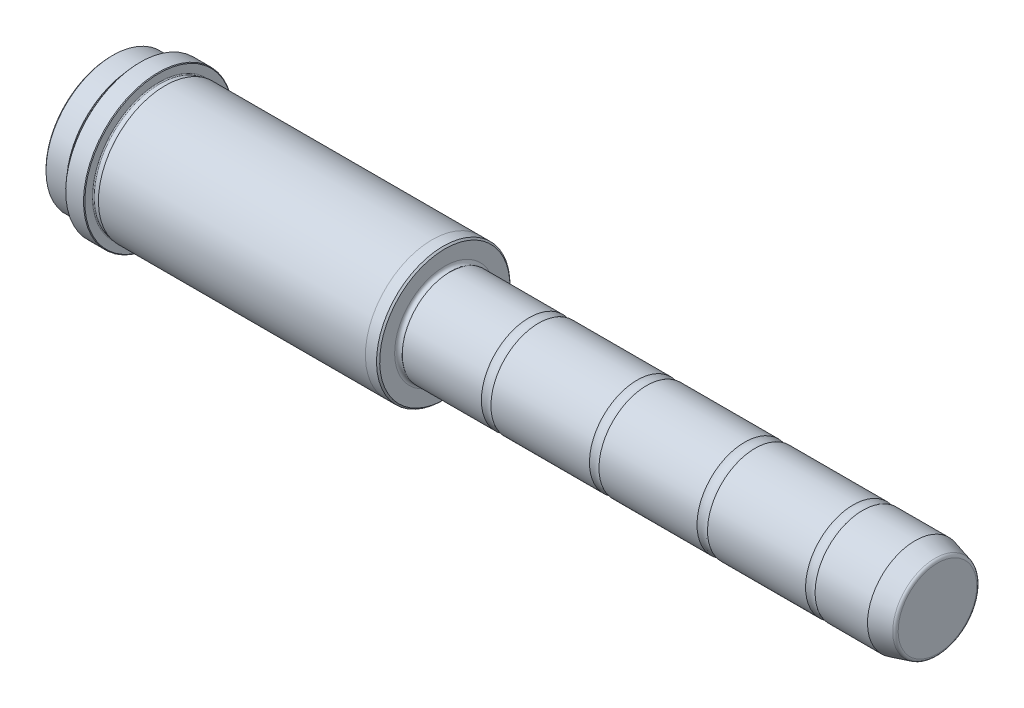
ISO-10303-21;
HEADER;
FILE_DESCRIPTION(('STEP AP214'),'2;1');
FILE_NAME('part.step','',(''),(''),'','','');
FILE_SCHEMA(('AUTOMOTIVE_DESIGN { 1 0 10303 214 1 1 1 1 }'));
ENDSEC;
DATA;
#1=APPLICATION_CONTEXT('core data for automotive mechanical design processes');
#2=APPLICATION_PROTOCOL_DEFINITION('international standard','automotive_design',2000,#1);
#3=PRODUCT_CONTEXT('',#1,'mechanical');
#4=PRODUCT('Part','Part','',(#3));
#5=PRODUCT_RELATED_PRODUCT_CATEGORY('part','',(#4));
#6=PRODUCT_DEFINITION_FORMATION('','',#4);
#7=PRODUCT_DEFINITION_CONTEXT('part definition',#1,'design');
#8=PRODUCT_DEFINITION('design','',#6,#7);
#9=PRODUCT_DEFINITION_SHAPE('','',#8);
#10=(LENGTH_UNIT() NAMED_UNIT(*) SI_UNIT(.MILLI.,.METRE.));
#11=(NAMED_UNIT(*) PLANE_ANGLE_UNIT() SI_UNIT($,.RADIAN.));
#12=(NAMED_UNIT(*) SI_UNIT($,.STERADIAN.) SOLID_ANGLE_UNIT());
#13=UNCERTAINTY_MEASURE_WITH_UNIT(LENGTH_MEASURE(1.E-05),#10,'distance_accuracy_value','');
#14=(GEOMETRIC_REPRESENTATION_CONTEXT(3) GLOBAL_UNCERTAINTY_ASSIGNED_CONTEXT((#13)) GLOBAL_UNIT_ASSIGNED_CONTEXT((#10,
#11,#12)) REPRESENTATION_CONTEXT('',''));
#15=CARTESIAN_POINT('',(0.,0.,0.));
#16=DIRECTION('',(0.,0.,1.));
#17=DIRECTION('',(1.,0.,0.));
#18=AXIS2_PLACEMENT_3D('',#15,#16,#17);
#19=CARTESIAN_POINT('',(155.,0.,0.));
#20=DIRECTION('',(1.,0.,0.));
#21=DIRECTION('',(0.,1.,0.));
#22=AXIS2_PLACEMENT_3D('',#19,#20,#21);
#23=CYLINDRICAL_SURFACE('',#22,15.);
#24=CARTESIAN_POINT('',(1.59999999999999,0.,0.));
#25=DIRECTION('',(1.,0.,0.));
#26=DIRECTION('',(0.,1.,0.));
#27=AXIS2_PLACEMENT_3D('',#24,#25,#26);
#28=CIRCLE('',#27,15.);
#29=CARTESIAN_POINT('',(1.59999999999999,15.,0.));
#30=VERTEX_POINT('',#29);
#31=EDGE_CURVE('E105',#30,#30,#28,.T.);
#32=ORIENTED_EDGE('',*,*,#31,.T.);
#33=EDGE_LOOP('',(#32));
#34=FACE_BOUND('',#33,.T.);
#35=CARTESIAN_POINT('',(26.5033370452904,0.,0.));
#36=DIRECTION('',(-1.,0.,0.));
#37=DIRECTION('',(0.,-1.,0.));
#38=AXIS2_PLACEMENT_3D('',#35,#36,#37);
#39=CIRCLE('',#38,15.);
#40=CARTESIAN_POINT('',(26.5033370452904,-14.9999999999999,0.));
#41=VERTEX_POINT('',#40);
#42=EDGE_CURVE('E132',#41,#41,#39,.T.);
#43=ORIENTED_EDGE('',*,*,#42,.T.);
#44=EDGE_LOOP('',(#43));
#45=FACE_BOUND('',#44,.T.);
#46=ADVANCED_FACE('F28',(#34,#45),#23,.T.);
#47=CARTESIAN_POINT('',(-105.,21.,0.));
#48=DIRECTION('',(-1.,0.,0.));
#49=DIRECTION('',(0.,-1.,0.));
#50=AXIS2_PLACEMENT_3D('',#47,#48,#49);
#51=PLANE('',#50);
#52=CARTESIAN_POINT('',(-105.,0.,0.));
#53=DIRECTION('',(-1.,0.,0.));
#54=DIRECTION('',(0.,-1.,0.));
#55=AXIS2_PLACEMENT_3D('',#52,#53,#54);
#56=CIRCLE('',#55,20.5);
#57=CARTESIAN_POINT('',(-105.,-20.5,0.));
#58=VERTEX_POINT('',#57);
#59=EDGE_CURVE('E39',#58,#58,#56,.T.);
#60=ORIENTED_EDGE('',*,*,#59,.T.);
#61=EDGE_LOOP('',(#60));
#62=FACE_BOUND('',#61,.T.);
#63=ADVANCED_FACE('F155',(#62),#51,.T.);
#64=CARTESIAN_POINT('',(155.,0.,0.));
#65=DIRECTION('',(1.,0.,0.));
#66=DIRECTION('',(0.,1.,0.));
#67=AXIS2_PLACEMENT_3D('',#64,#65,#66);
#68=CYLINDRICAL_SURFACE('',#67,21.);
#69=CARTESIAN_POINT('',(-104.5,0.,0.));
#70=DIRECTION('',(-1.,0.,0.));
#71=DIRECTION('',(0.,-1.,0.));
#72=AXIS2_PLACEMENT_3D('',#69,#70,#71);
#73=CIRCLE('',#72,21.);
#74=CARTESIAN_POINT('',(-104.5,-21.,0.));
#75=VERTEX_POINT('',#74);
#76=EDGE_CURVE('E43',#75,#75,#73,.F.);
#77=ORIENTED_EDGE('',*,*,#76,.T.);
#78=EDGE_LOOP('',(#77));
#79=FACE_BOUND('',#78,.T.);
#80=CARTESIAN_POINT('',(-98.,0.,0.));
#81=DIRECTION('',(1.,0.,0.));
#82=DIRECTION('',(0.,1.,0.));
#83=AXIS2_PLACEMENT_3D('',#80,#81,#82);
#84=CIRCLE('',#83,21.);
#85=CARTESIAN_POINT('',(-98.,21.,0.));
#86=VERTEX_POINT('',#85);
#87=EDGE_CURVE('E66',#86,#86,#84,.T.);
#88=ORIENTED_EDGE('',*,*,#87,.F.);
#89=EDGE_LOOP('',(#88));
#90=FACE_BOUND('',#89,.T.);
#91=ADVANCED_FACE('F163',(#79,#90),#68,.T.);
#92=CARTESIAN_POINT('',(-98.,20.9,0.));
#93=DIRECTION('',(1.,0.,0.));
#94=DIRECTION('',(0.,1.,0.));
#95=AXIS2_PLACEMENT_3D('',#92,#93,#94);
#96=PLANE('',#95);
#97=ORIENTED_EDGE('',*,*,#87,.T.);
#98=EDGE_LOOP('',(#97));
#99=FACE_BOUND('',#98,.T.);
#100=CARTESIAN_POINT('',(-98.,0.,0.));
#101=DIRECTION('',(1.,0.,0.));
#102=DIRECTION('',(0.,1.,0.));
#103=AXIS2_PLACEMENT_3D('',#100,#101,#102);
#104=CIRCLE('',#103,20.9);
#105=CARTESIAN_POINT('',(-98.,20.9,0.));
#106=VERTEX_POINT('',#105);
#107=EDGE_CURVE('E69',#106,#106,#104,.T.);
#108=ORIENTED_EDGE('',*,*,#107,.F.);
#109=EDGE_LOOP('',(#108));
#110=FACE_BOUND('',#109,.T.);
#111=ADVANCED_FACE('F430',(#99,#110),#96,.T.);
#112=CARTESIAN_POINT('',(-97.7,0.,0.));
#113=DIRECTION('',(1.,0.,0.));
#114=DIRECTION('',(0.,1.,0.));
#115=AXIS2_PLACEMENT_3D('',#112,#113,#114);
#116=TOROIDAL_SURFACE('',#115,20.9,0.299999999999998);
#117=ORIENTED_EDGE('',*,*,#107,.T.);
#118=EDGE_LOOP('',(#117));
#119=FACE_BOUND('',#118,.T.);
#120=CARTESIAN_POINT('',(-97.7,0.,0.));
#121=DIRECTION('',(1.,0.,0.));
#122=DIRECTION('',(0.,1.,0.));
#123=AXIS2_PLACEMENT_3D('',#120,#121,#122);
#124=CIRCLE('',#123,20.6);
#125=CARTESIAN_POINT('',(-97.7,20.6,0.));
#126=VERTEX_POINT('',#125);
#127=EDGE_CURVE('E72',#126,#126,#124,.T.);
#128=ORIENTED_EDGE('',*,*,#127,.F.);
#129=EDGE_LOOP('',(#128));
#130=FACE_BOUND('',#129,.T.);
#131=ADVANCED_FACE('F421',(#119,#130),#116,.F.);
#132=CARTESIAN_POINT('',(155.,0.,0.));
#133=DIRECTION('',(1.,0.,0.));
#134=DIRECTION('',(0.,1.,0.));
#135=AXIS2_PLACEMENT_3D('',#132,#133,#134);
#136=CYLINDRICAL_SURFACE('',#135,20.6);
#137=ORIENTED_EDGE('',*,*,#127,.T.);
#138=EDGE_LOOP('',(#137));
#139=FACE_BOUND('',#138,.T.);
#140=CARTESIAN_POINT('',(-96.3,0.,0.));
#141=DIRECTION('',(1.,0.,0.));
#142=DIRECTION('',(0.,1.,0.));
#143=AXIS2_PLACEMENT_3D('',#140,#141,#142);
#144=CIRCLE('',#143,20.6);
#145=CARTESIAN_POINT('',(-96.3,20.6,0.));
#146=VERTEX_POINT('',#145);
#147=EDGE_CURVE('E75',#146,#146,#144,.T.);
#148=ORIENTED_EDGE('',*,*,#147,.F.);
#149=EDGE_LOOP('',(#148));
#150=FACE_BOUND('',#149,.T.);
#151=ADVANCED_FACE('F412',(#139,#150),#136,.T.);
#152=CARTESIAN_POINT('',(-96.3,0.,0.));
#153=DIRECTION('',(1.,0.,0.));
#154=DIRECTION('',(0.,1.,0.));
#155=AXIS2_PLACEMENT_3D('',#152,#153,#154);
#156=TOROIDAL_SURFACE('',#155,20.9,0.299999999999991);
#157=ORIENTED_EDGE('',*,*,#147,.T.);
#158=EDGE_LOOP('',(#157));
#159=FACE_BOUND('',#158,.T.);
#160=CARTESIAN_POINT('',(-96.,0.,0.));
#161=DIRECTION('',(1.,0.,0.));
#162=DIRECTION('',(0.,1.,0.));
#163=AXIS2_PLACEMENT_3D('',#160,#161,#162);
#164=CIRCLE('',#163,20.9);
#165=CARTESIAN_POINT('',(-96.,20.9,0.));
#166=VERTEX_POINT('',#165);
#167=EDGE_CURVE('E78',#166,#166,#164,.T.);
#168=ORIENTED_EDGE('',*,*,#167,.F.);
#169=EDGE_LOOP('',(#168));
#170=FACE_BOUND('',#169,.T.);
#171=ADVANCED_FACE('F404',(#159,#170),#156,.F.);
#172=CARTESIAN_POINT('',(-96.,23.5,0.));
#173=DIRECTION('',(-1.,0.,0.));
#174=DIRECTION('',(0.,-1.,0.));
#175=AXIS2_PLACEMENT_3D('',#172,#173,#174);
#176=PLANE('',#175);
#177=CARTESIAN_POINT('',(-96.,0.,0.));
#178=DIRECTION('',(-1.,0.,0.));
#179=DIRECTION('',(0.,-1.,0.));
#180=AXIS2_PLACEMENT_3D('',#177,#178,#179);
#181=CIRCLE('',#180,23.3);
#182=CARTESIAN_POINT('',(-96.,-23.3,0.));
#183=VERTEX_POINT('',#182);
#184=EDGE_CURVE('E51',#183,#183,#181,.T.);
#185=ORIENTED_EDGE('',*,*,#184,.T.);
#186=EDGE_LOOP('',(#185));
#187=FACE_BOUND('',#186,.T.);
#188=ORIENTED_EDGE('',*,*,#167,.T.);
#189=EDGE_LOOP('',(#188));
#190=FACE_BOUND('',#189,.T.);
#191=ADVANCED_FACE('F396',(#187,#190),#176,.T.);
#192=CARTESIAN_POINT('',(155.,0.,0.));
#193=DIRECTION('',(1.,0.,0.));
#194=DIRECTION('',(0.,1.,0.));
#195=AXIS2_PLACEMENT_3D('',#192,#193,#194);
#196=CYLINDRICAL_SURFACE('',#195,23.5);
#197=CARTESIAN_POINT('',(-95.8,0.,0.));
#198=DIRECTION('',(-1.,0.,0.));
#199=DIRECTION('',(0.,-1.,0.));
#200=AXIS2_PLACEMENT_3D('',#197,#198,#199);
#201=CIRCLE('',#200,23.5);
#202=CARTESIAN_POINT('',(-95.8,-23.5,0.));
#203=VERTEX_POINT('',#202);
#204=EDGE_CURVE('E54',#203,#203,#201,.F.);
#205=ORIENTED_EDGE('',*,*,#204,.T.);
#206=EDGE_LOOP('',(#205));
#207=FACE_BOUND('',#206,.T.);
#208=CARTESIAN_POINT('',(-90.2,0.,0.));
#209=DIRECTION('',(1.,0.,0.));
#210=DIRECTION('',(0.,1.,0.));
#211=AXIS2_PLACEMENT_3D('',#208,#209,#210);
#212=CIRCLE('',#211,23.5);
#213=CARTESIAN_POINT('',(-90.2,-23.5,0.));
#214=VERTEX_POINT('',#213);
#215=EDGE_CURVE('E57',#214,#214,#212,.F.);
#216=ORIENTED_EDGE('',*,*,#215,.T.);
#217=EDGE_LOOP('',(#216));
#218=FACE_BOUND('',#217,.T.);
#219=ADVANCED_FACE('F387',(#207,#218),#196,.T.);
#220=CARTESIAN_POINT('',(-90.,20.9,0.));
#221=DIRECTION('',(1.,0.,0.));
#222=DIRECTION('',(0.,1.,0.));
#223=AXIS2_PLACEMENT_3D('',#220,#221,#222);
#224=PLANE('',#223);
#225=CARTESIAN_POINT('',(-90.,0.,0.));
#226=DIRECTION('',(1.,0.,0.));
#227=DIRECTION('',(0.,1.,0.));
#228=AXIS2_PLACEMENT_3D('',#225,#226,#227);
#229=CIRCLE('',#228,23.3);
#230=CARTESIAN_POINT('',(-90.,-23.3,0.));
#231=VERTEX_POINT('',#230);
#232=EDGE_CURVE('E48',#231,#231,#229,.T.);
#233=ORIENTED_EDGE('',*,*,#232,.T.);
#234=EDGE_LOOP('',(#233));
#235=FACE_BOUND('',#234,.T.);
#236=CARTESIAN_POINT('',(-90.,0.,0.));
#237=DIRECTION('',(1.,0.,0.));
#238=DIRECTION('',(0.,1.,0.));
#239=AXIS2_PLACEMENT_3D('',#236,#237,#238);
#240=CIRCLE('',#239,20.9);
#241=CARTESIAN_POINT('',(-90.,20.9,0.));
#242=VERTEX_POINT('',#241);
#243=EDGE_CURVE('E81',#242,#242,#240,.T.);
#244=ORIENTED_EDGE('',*,*,#243,.F.);
#245=EDGE_LOOP('',(#244));
#246=FACE_BOUND('',#245,.T.);
#247=ADVANCED_FACE('F378',(#235,#246),#224,.T.);
#248=CARTESIAN_POINT('',(-89.7,0.,0.));
#249=DIRECTION('',(1.,0.,0.));
#250=DIRECTION('',(0.,1.,0.));
#251=AXIS2_PLACEMENT_3D('',#248,#249,#250);
#252=TOROIDAL_SURFACE('',#251,20.9,0.299999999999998);
#253=ORIENTED_EDGE('',*,*,#243,.T.);
#254=EDGE_LOOP('',(#253));
#255=FACE_BOUND('',#254,.T.);
#256=CARTESIAN_POINT('',(-89.7,0.,0.));
#257=DIRECTION('',(1.,0.,0.));
#258=DIRECTION('',(0.,1.,0.));
#259=AXIS2_PLACEMENT_3D('',#256,#257,#258);
#260=CIRCLE('',#259,20.6);
#261=CARTESIAN_POINT('',(-89.7,20.6,0.));
#262=VERTEX_POINT('',#261);
#263=EDGE_CURVE('E84',#262,#262,#260,.T.);
#264=ORIENTED_EDGE('',*,*,#263,.F.);
#265=EDGE_LOOP('',(#264));
#266=FACE_BOUND('',#265,.T.);
#267=ADVANCED_FACE('F369',(#255,#266),#252,.F.);
#268=CARTESIAN_POINT('',(155.,0.,0.));
#269=DIRECTION('',(1.,0.,0.));
#270=DIRECTION('',(0.,1.,0.));
#271=AXIS2_PLACEMENT_3D('',#268,#269,#270);
#272=CYLINDRICAL_SURFACE('',#271,20.6);
#273=ORIENTED_EDGE('',*,*,#263,.T.);
#274=EDGE_LOOP('',(#273));
#275=FACE_BOUND('',#274,.T.);
#276=CARTESIAN_POINT('',(-88.3,0.,0.));
#277=DIRECTION('',(1.,0.,0.));
#278=DIRECTION('',(0.,1.,0.));
#279=AXIS2_PLACEMENT_3D('',#276,#277,#278);
#280=CIRCLE('',#279,20.6);
#281=CARTESIAN_POINT('',(-88.3,20.6,0.));
#282=VERTEX_POINT('',#281);
#283=EDGE_CURVE('E87',#282,#282,#280,.T.);
#284=ORIENTED_EDGE('',*,*,#283,.F.);
#285=EDGE_LOOP('',(#284));
#286=FACE_BOUND('',#285,.T.);
#287=ADVANCED_FACE('F360',(#275,#286),#272,.T.);
#288=CARTESIAN_POINT('',(-88.3,0.,0.));
#289=DIRECTION('',(1.,0.,0.));
#290=DIRECTION('',(0.,1.,0.));
#291=AXIS2_PLACEMENT_3D('',#288,#289,#290);
#292=TOROIDAL_SURFACE('',#291,20.9,0.299999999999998);
#293=ORIENTED_EDGE('',*,*,#283,.T.);
#294=EDGE_LOOP('',(#293));
#295=FACE_BOUND('',#294,.T.);
#296=CARTESIAN_POINT('',(-88.,0.,0.));
#297=DIRECTION('',(1.,0.,0.));
#298=DIRECTION('',(0.,1.,0.));
#299=AXIS2_PLACEMENT_3D('',#296,#297,#298);
#300=CIRCLE('',#299,20.9);
#301=CARTESIAN_POINT('',(-88.,20.9,0.));
#302=VERTEX_POINT('',#301);
#303=EDGE_CURVE('E90',#302,#302,#300,.T.);
#304=ORIENTED_EDGE('',*,*,#303,.F.);
#305=EDGE_LOOP('',(#304));
#306=FACE_BOUND('',#305,.T.);
#307=ADVANCED_FACE('F351',(#295,#306),#292,.F.);
#308=CARTESIAN_POINT('',(-88.,21.0001,0.));
#309=DIRECTION('',(-1.,0.,0.));
#310=DIRECTION('',(0.,-1.,0.));
#311=AXIS2_PLACEMENT_3D('',#308,#309,#310);
#312=PLANE('',#311);
#313=ORIENTED_EDGE('',*,*,#303,.T.);
#314=EDGE_LOOP('',(#313));
#315=FACE_BOUND('',#314,.T.);
#316=CARTESIAN_POINT('',(-88.,0.,0.));
#317=DIRECTION('',(1.,0.,0.));
#318=DIRECTION('',(0.,1.,0.));
#319=AXIS2_PLACEMENT_3D('',#316,#317,#318);
#320=CIRCLE('',#319,21.0001);
#321=CARTESIAN_POINT('',(-88.,21.0001,0.));
#322=VERTEX_POINT('',#321);
#323=EDGE_CURVE('E93',#322,#322,#320,.T.);
#324=ORIENTED_EDGE('',*,*,#323,.F.);
#325=EDGE_LOOP('',(#324));
#326=FACE_BOUND('',#325,.T.);
#327=ADVANCED_FACE('F342',(#315,#326),#312,.T.);
#328=CARTESIAN_POINT('',(155.,0.,0.));
#329=DIRECTION('',(1.,0.,0.));
#330=DIRECTION('',(0.,1.,0.));
#331=AXIS2_PLACEMENT_3D('',#328,#329,#330);
#332=CYLINDRICAL_SURFACE('',#331,21.0001);
#333=ORIENTED_EDGE('',*,*,#323,.T.);
#334=EDGE_LOOP('',(#333));
#335=FACE_BOUND('',#334,.T.);
#336=CARTESIAN_POINT('',(-4.,0.,0.));
#337=DIRECTION('',(1.,0.,0.));
#338=DIRECTION('',(0.,1.,0.));
#339=AXIS2_PLACEMENT_3D('',#336,#337,#338);
#340=CIRCLE('',#339,21.0001);
#341=CARTESIAN_POINT('',(-4.00000000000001,21.0001,0.));
#342=VERTEX_POINT('',#341);
#343=EDGE_CURVE('E96',#342,#342,#340,.T.);
#344=ORIENTED_EDGE('',*,*,#343,.F.);
#345=EDGE_LOOP('',(#344));
#346=FACE_BOUND('',#345,.T.);
#347=ADVANCED_FACE('F333',(#335,#346),#332,.T.);
#348=CARTESIAN_POINT('',(-4.,21.0001,0.));
#349=DIRECTION('',(1.,0.,0.));
#350=DIRECTION('',(0.,1.,0.));
#351=AXIS2_PLACEMENT_3D('',#348,#349,#350);
#352=PLANE('',#351);
#353=ORIENTED_EDGE('',*,*,#343,.T.);
#354=EDGE_LOOP('',(#353));
#355=FACE_BOUND('',#354,.T.);
#356=CARTESIAN_POINT('',(-4.,0.,0.));
#357=DIRECTION('',(1.,0.,0.));
#358=DIRECTION('',(0.,1.,0.));
#359=AXIS2_PLACEMENT_3D('',#356,#357,#358);
#360=CIRCLE('',#359,21.);
#361=CARTESIAN_POINT('',(-4.00000000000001,21.,0.));
#362=VERTEX_POINT('',#361);
#363=EDGE_CURVE('E99',#362,#362,#360,.T.);
#364=ORIENTED_EDGE('',*,*,#363,.F.);
#365=EDGE_LOOP('',(#364));
#366=FACE_BOUND('',#365,.T.);
#367=ADVANCED_FACE('F325',(#355,#366),#352,.T.);
#368=CARTESIAN_POINT('',(155.,0.,0.));
#369=DIRECTION('',(1.,0.,0.));
#370=DIRECTION('',(0.,1.,0.));
#371=AXIS2_PLACEMENT_3D('',#368,#369,#370);
#372=CYLINDRICAL_SURFACE('',#371,21.);
#373=CARTESIAN_POINT('',(-0.500000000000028,0.,0.));
#374=DIRECTION('',(1.,0.,0.));
#375=DIRECTION('',(0.,1.,0.));
#376=AXIS2_PLACEMENT_3D('',#373,#374,#375);
#377=CIRCLE('',#376,21.);
#378=CARTESIAN_POINT('',(-0.500000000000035,21.,0.));
#379=VERTEX_POINT('',#378);
#380=EDGE_CURVE('E10',#379,#379,#377,.F.);
#381=ORIENTED_EDGE('',*,*,#380,.T.);
#382=EDGE_LOOP('',(#381));
#383=FACE_BOUND('',#382,.T.);
#384=ORIENTED_EDGE('',*,*,#363,.T.);
#385=EDGE_LOOP('',(#384));
#386=FACE_BOUND('',#385,.T.);
#387=ADVANCED_FACE('F317',(#383,#386),#372,.T.);
#388=CARTESIAN_POINT('',(0.,15.8,0.));
#389=DIRECTION('',(1.,0.,0.));
#390=DIRECTION('',(0.,1.,0.));
#391=AXIS2_PLACEMENT_3D('',#388,#389,#390);
#392=PLANE('',#391);
#393=CARTESIAN_POINT('',(0.,0.,0.));
#394=DIRECTION('',(1.,0.,0.));
#395=DIRECTION('',(0.,1.,0.));
#396=AXIS2_PLACEMENT_3D('',#393,#394,#395);
#397=CIRCLE('',#396,20.5);
#398=CARTESIAN_POINT('',(0.,20.5,0.));
#399=VERTEX_POINT('',#398);
#400=EDGE_CURVE('E35',#399,#399,#397,.T.);
#401=ORIENTED_EDGE('',*,*,#400,.T.);
#402=EDGE_LOOP('',(#401));
#403=FACE_BOUND('',#402,.T.);
#404=CARTESIAN_POINT('',(0.,0.,0.));
#405=DIRECTION('',(1.,0.,0.));
#406=DIRECTION('',(0.,1.,0.));
#407=AXIS2_PLACEMENT_3D('',#404,#405,#406);
#408=CIRCLE('',#407,15.8);
#409=CARTESIAN_POINT('',(0.,15.8,0.));
#410=VERTEX_POINT('',#409);
#411=EDGE_CURVE('E102',#410,#410,#408,.T.);
#412=ORIENTED_EDGE('',*,*,#411,.F.);
#413=EDGE_LOOP('',(#412));
#414=FACE_BOUND('',#413,.T.);
#415=ADVANCED_FACE('F150',(#403,#414),#392,.T.);
#416=CARTESIAN_POINT('',(1.,0.,0.));
#417=DIRECTION('',(1.,0.,0.));
#418=DIRECTION('',(0.,1.,0.));
#419=AXIS2_PLACEMENT_3D('',#416,#417,#418);
#420=TOROIDAL_SURFACE('',#419,15.8,1.);
#421=ORIENTED_EDGE('',*,*,#411,.T.);
#422=EDGE_LOOP('',(#421));
#423=FACE_BOUND('',#422,.T.);
#424=ORIENTED_EDGE('',*,*,#31,.F.);
#425=EDGE_LOOP('',(#424));
#426=FACE_BOUND('',#425,.T.);
#427=ADVANCED_FACE('F140',(#423,#426),#420,.F.);
#428=CARTESIAN_POINT('',(28.,0.,0.));
#429=DIRECTION('',(-1.,0.,0.));
#430=DIRECTION('',(0.,-1.,0.));
#431=AXIS2_PLACEMENT_3D('',#428,#429,#430);
#432=TOROIDAL_SURFACE('',#431,17.6,3.);
#433=CARTESIAN_POINT('',(29.4966629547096,0.,0.));
#434=DIRECTION('',(-1.,0.,0.));
#435=DIRECTION('',(0.,-1.,0.));
#436=AXIS2_PLACEMENT_3D('',#433,#434,#435);
#437=CIRCLE('',#436,15.);
#438=CARTESIAN_POINT('',(29.4966629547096,-14.9999999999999,0.));
#439=VERTEX_POINT('',#438);
#440=EDGE_CURVE('E129',#439,#439,#437,.T.);
#441=ORIENTED_EDGE('',*,*,#440,.T.);
#442=EDGE_LOOP('',(#441));
#443=FACE_BOUND('',#442,.T.);
#444=ORIENTED_EDGE('',*,*,#42,.F.);
#445=EDGE_LOOP('',(#444));
#446=FACE_BOUND('',#445,.T.);
#447=ADVANCED_FACE('F137',(#443,#446),#432,.F.);
#448=CARTESIAN_POINT('',(155.,13.1243556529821,0.));
#449=DIRECTION('',(1.,0.,0.));
#450=DIRECTION('',(0.,1.,0.));
#451=AXIS2_PLACEMENT_3D('',#448,#449,#450);
#452=PLANE('',#451);
#453=CARTESIAN_POINT('',(155.,0.,0.));
#454=DIRECTION('',(1.,0.,0.));
#455=DIRECTION('',(0.,1.,0.));
#456=AXIS2_PLACEMENT_3D('',#453,#454,#455);
#457=CIRCLE('',#456,12.3570286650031);
#458=CARTESIAN_POINT('',(155.,12.3570286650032,0.));
#459=VERTEX_POINT('',#458);
#460=EDGE_CURVE('E63',#459,#459,#457,.T.);
#461=ORIENTED_EDGE('',*,*,#460,.T.);
#462=EDGE_LOOP('',(#461));
#463=FACE_BOUND('',#462,.T.);
#464=ADVANCED_FACE('F139',(#463),#452,.T.);
#465=CARTESIAN_POINT('',(155.,0.,0.));
#466=DIRECTION('',(-1.,0.,0.));
#467=DIRECTION('',(0.,-1.,0.));
#468=AXIS2_PLACEMENT_3D('',#465,#466,#467);
#469=CONICAL_SURFACE('',#468,13.1243556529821,0.26179938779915);
#470=CARTESIAN_POINT('',(154.258819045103,0.,0.));
#471=DIRECTION('',(1.,0.,0.));
#472=DIRECTION('',(0.,1.,0.));
#473=AXIS2_PLACEMENT_3D('',#470,#471,#472);
#474=CIRCLE('',#473,13.3229544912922);
#475=CARTESIAN_POINT('',(154.258819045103,13.3229544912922,0.));
#476=VERTEX_POINT('',#475);
#477=EDGE_CURVE('E60',#476,#476,#474,.F.);
#478=ORIENTED_EDGE('',*,*,#477,.T.);
#479=EDGE_LOOP('',(#478));
#480=FACE_BOUND('',#479,.T.);
#481=CARTESIAN_POINT('',(148.,0.,0.));
#482=DIRECTION('',(1.,0.,0.));
#483=DIRECTION('',(0.,1.,0.));
#484=AXIS2_PLACEMENT_3D('',#481,#482,#483);
#485=CIRCLE('',#484,14.9999999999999);
#486=CARTESIAN_POINT('',(148.,15.,0.));
#487=VERTEX_POINT('',#486);
#488=EDGE_CURVE('E108',#487,#487,#485,.T.);
#489=ORIENTED_EDGE('',*,*,#488,.T.);
#490=EDGE_LOOP('',(#489));
#491=FACE_BOUND('',#490,.T.);
#492=ADVANCED_FACE('F147',(#480,#491),#469,.T.);
#493=ORIENTED_EDGE('',*,*,#488,.F.);
#494=EDGE_LOOP('',(#493));
#495=FACE_BOUND('',#494,.T.);
#496=CARTESIAN_POINT('',(131.49666295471,0.,0.));
#497=DIRECTION('',(-1.,0.,0.));
#498=DIRECTION('',(0.,-1.,0.));
#499=AXIS2_PLACEMENT_3D('',#496,#497,#498);
#500=CIRCLE('',#499,15.);
#501=CARTESIAN_POINT('',(131.49666295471,-14.9999999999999,0.));
#502=VERTEX_POINT('',#501);
#503=EDGE_CURVE('E111',#502,#502,#500,.T.);
#504=ORIENTED_EDGE('',*,*,#503,.F.);
#505=EDGE_LOOP('',(#504));
#506=FACE_BOUND('',#505,.T.);
#507=ADVANCED_FACE('F159',(#495,#506),#23,.T.);
#508=CARTESIAN_POINT('',(130.,0.,0.));
#509=DIRECTION('',(-1.,0.,0.));
#510=DIRECTION('',(0.,-1.,0.));
#511=AXIS2_PLACEMENT_3D('',#508,#509,#510);
#512=TOROIDAL_SURFACE('',#511,17.6,3.);
#513=ORIENTED_EDGE('',*,*,#503,.T.);
#514=EDGE_LOOP('',(#513));
#515=FACE_BOUND('',#514,.T.);
#516=CARTESIAN_POINT('',(128.50333704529,0.,0.));
#517=DIRECTION('',(-1.,0.,0.));
#518=DIRECTION('',(0.,-1.,0.));
#519=AXIS2_PLACEMENT_3D('',#516,#517,#518);
#520=CIRCLE('',#519,15.);
#521=CARTESIAN_POINT('',(128.50333704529,-14.9999999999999,0.));
#522=VERTEX_POINT('',#521);
#523=EDGE_CURVE('E114',#522,#522,#520,.T.);
#524=ORIENTED_EDGE('',*,*,#523,.F.);
#525=EDGE_LOOP('',(#524));
#526=FACE_BOUND('',#525,.T.);
#527=ADVANCED_FACE('F173',(#515,#526),#512,.F.);
#528=ORIENTED_EDGE('',*,*,#523,.T.);
#529=EDGE_LOOP('',(#528));
#530=FACE_BOUND('',#529,.T.);
#531=CARTESIAN_POINT('',(97.6583123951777,0.,0.));
#532=DIRECTION('',(-1.,0.,0.));
#533=DIRECTION('',(0.,-1.,0.));
#534=AXIS2_PLACEMENT_3D('',#531,#532,#533);
#535=CIRCLE('',#534,15.);
#536=CARTESIAN_POINT('',(97.6583123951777,-14.9999999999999,0.));
#537=VERTEX_POINT('',#536);
#538=EDGE_CURVE('E117',#537,#537,#535,.T.);
#539=ORIENTED_EDGE('',*,*,#538,.F.);
#540=EDGE_LOOP('',(#539));
#541=FACE_BOUND('',#540,.T.);
#542=ADVANCED_FACE('F175',(#530,#541),#23,.T.);
#543=CARTESIAN_POINT('',(96.,0.,0.));
#544=DIRECTION('',(-1.,0.,0.));
#545=DIRECTION('',(0.,-1.,0.));
#546=AXIS2_PLACEMENT_3D('',#543,#544,#545);
#547=TOROIDAL_SURFACE('',#546,17.5,3.00000000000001);
#548=ORIENTED_EDGE('',*,*,#538,.T.);
#549=EDGE_LOOP('',(#548));
#550=FACE_BOUND('',#549,.T.);
#551=CARTESIAN_POINT('',(94.3416876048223,0.,0.));
#552=DIRECTION('',(-1.,0.,0.));
#553=DIRECTION('',(0.,-1.,0.));
#554=AXIS2_PLACEMENT_3D('',#551,#552,#553);
#555=CIRCLE('',#554,15.);
#556=CARTESIAN_POINT('',(94.3416876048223,-14.9999999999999,0.));
#557=VERTEX_POINT('',#556);
#558=EDGE_CURVE('E120',#557,#557,#555,.T.);
#559=ORIENTED_EDGE('',*,*,#558,.F.);
#560=EDGE_LOOP('',(#559));
#561=FACE_BOUND('',#560,.T.);
#562=ADVANCED_FACE('F186',(#550,#561),#547,.F.);
#563=ORIENTED_EDGE('',*,*,#558,.T.);
#564=EDGE_LOOP('',(#563));
#565=FACE_BOUND('',#564,.T.);
#566=CARTESIAN_POINT('',(63.4966629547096,0.,0.));
#567=DIRECTION('',(-1.,0.,0.));
#568=DIRECTION('',(0.,-1.,0.));
#569=AXIS2_PLACEMENT_3D('',#566,#567,#568);
#570=CIRCLE('',#569,15.);
#571=CARTESIAN_POINT('',(63.4966629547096,-14.9999999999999,0.));
#572=VERTEX_POINT('',#571);
#573=EDGE_CURVE('E123',#572,#572,#570,.T.);
#574=ORIENTED_EDGE('',*,*,#573,.F.);
#575=EDGE_LOOP('',(#574));
#576=FACE_BOUND('',#575,.T.);
#577=ADVANCED_FACE('F171',(#565,#576),#23,.T.);
#578=CARTESIAN_POINT('',(62.,0.,0.));
#579=DIRECTION('',(-1.,0.,0.));
#580=DIRECTION('',(0.,-1.,0.));
#581=AXIS2_PLACEMENT_3D('',#578,#579,#580);
#582=TOROIDAL_SURFACE('',#581,17.6,3.);
#583=ORIENTED_EDGE('',*,*,#573,.T.);
#584=EDGE_LOOP('',(#583));
#585=FACE_BOUND('',#584,.T.);
#586=CARTESIAN_POINT('',(60.5033370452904,0.,0.));
#587=DIRECTION('',(-1.,0.,0.));
#588=DIRECTION('',(0.,-1.,0.));
#589=AXIS2_PLACEMENT_3D('',#586,#587,#588);
#590=CIRCLE('',#589,15.);
#591=CARTESIAN_POINT('',(60.5033370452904,-14.9999999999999,0.));
#592=VERTEX_POINT('',#591);
#593=EDGE_CURVE('E126',#592,#592,#590,.T.);
#594=ORIENTED_EDGE('',*,*,#593,.F.);
#595=EDGE_LOOP('',(#594));
#596=FACE_BOUND('',#595,.T.);
#597=ADVANCED_FACE('F169',(#585,#596),#582,.F.);
#598=ORIENTED_EDGE('',*,*,#593,.T.);
#599=EDGE_LOOP('',(#598));
#600=FACE_BOUND('',#599,.T.);
#601=ORIENTED_EDGE('',*,*,#440,.F.);
#602=EDGE_LOOP('',(#601));
#603=FACE_BOUND('',#602,.T.);
#604=ADVANCED_FACE('F158',(#600,#603),#23,.T.);
#605=CARTESIAN_POINT('',(154.,0.,0.));
#606=DIRECTION('',(1.,0.,0.));
#607=DIRECTION('',(0.,1.,0.));
#608=AXIS2_PLACEMENT_3D('',#605,#606,#607);
#609=TOROIDAL_SURFACE('',#608,12.3570286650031,1.);
#610=ORIENTED_EDGE('',*,*,#477,.F.);
#611=EDGE_LOOP('',(#610));
#612=FACE_BOUND('',#611,.T.);
#613=ORIENTED_EDGE('',*,*,#460,.F.);
#614=EDGE_LOOP('',(#613));
#615=FACE_BOUND('',#614,.T.);
#616=ADVANCED_FACE('F168',(#612,#615),#609,.T.);
#617=CARTESIAN_POINT('',(-95.8,0.,0.));
#618=DIRECTION('',(1.,0.,0.));
#619=DIRECTION('',(0.,1.,0.));
#620=AXIS2_PLACEMENT_3D('',#617,#618,#619);
#621=CONICAL_SURFACE('',#620,23.5,0.785398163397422);
#622=ORIENTED_EDGE('',*,*,#184,.F.);
#623=EDGE_LOOP('',(#622));
#624=FACE_BOUND('',#623,.T.);
#625=ORIENTED_EDGE('',*,*,#204,.F.);
#626=EDGE_LOOP('',(#625));
#627=FACE_BOUND('',#626,.T.);
#628=ADVANCED_FACE('F221',(#624,#627),#621,.T.);
#629=CARTESIAN_POINT('',(-90.,0.,0.));
#630=DIRECTION('',(-1.,0.,0.));
#631=DIRECTION('',(0.,-1.,0.));
#632=AXIS2_PLACEMENT_3D('',#629,#630,#631);
#633=CONICAL_SURFACE('',#632,23.3,0.785398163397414);
#634=CARTESIAN_POINT('',(-90.2,-23.5,0.));
#635=CARTESIAN_POINT('',(-90.1979166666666,-23.4979166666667,0.));
#636=CARTESIAN_POINT('',(-90.1958333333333,-23.4958333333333,0.));
#637=CARTESIAN_POINT('',(-90.1916666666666,-23.4916666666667,0.));
#638=CARTESIAN_POINT('',(-90.1895833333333,-23.4895833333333,0.));
#639=CARTESIAN_POINT('',(-90.1854166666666,-23.4854166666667,0.));
#640=CARTESIAN_POINT('',(-90.1833333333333,-23.4833333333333,0.));
#641=CARTESIAN_POINT('',(-90.1791666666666,-23.4791666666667,0.));
#642=CARTESIAN_POINT('',(-90.1770833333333,-23.4770833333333,0.));
#643=CARTESIAN_POINT('',(-90.1729166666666,-23.4729166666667,0.));
#644=CARTESIAN_POINT('',(-90.1708333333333,-23.4708333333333,0.));
#645=CARTESIAN_POINT('',(-90.1666666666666,-23.4666666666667,0.));
#646=CARTESIAN_POINT('',(-90.1645833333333,-23.4645833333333,0.));
#647=CARTESIAN_POINT('',(-90.1604166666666,-23.4604166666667,0.));
#648=CARTESIAN_POINT('',(-90.1583333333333,-23.4583333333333,0.));
#649=CARTESIAN_POINT('',(-90.1541666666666,-23.4541666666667,0.));
#650=CARTESIAN_POINT('',(-90.1520833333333,-23.4520833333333,0.));
#651=CARTESIAN_POINT('',(-90.1479166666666,-23.4479166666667,0.));
#652=CARTESIAN_POINT('',(-90.1458333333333,-23.4458333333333,0.));
#653=CARTESIAN_POINT('',(-90.1416666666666,-23.4416666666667,0.));
#654=CARTESIAN_POINT('',(-90.1395833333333,-23.4395833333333,0.));
#655=CARTESIAN_POINT('',(-90.1354166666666,-23.4354166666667,0.));
#656=CARTESIAN_POINT('',(-90.1333333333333,-23.4333333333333,0.));
#657=CARTESIAN_POINT('',(-90.1291666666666,-23.4291666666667,0.));
#658=CARTESIAN_POINT('',(-90.1270833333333,-23.4270833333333,0.));
#659=CARTESIAN_POINT('',(-90.1229166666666,-23.4229166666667,0.));
#660=CARTESIAN_POINT('',(-90.1208333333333,-23.4208333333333,0.));
#661=CARTESIAN_POINT('',(-90.1166666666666,-23.4166666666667,0.));
#662=CARTESIAN_POINT('',(-90.1145833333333,-23.4145833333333,0.));
#663=CARTESIAN_POINT('',(-90.1104166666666,-23.4104166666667,0.));
#664=CARTESIAN_POINT('',(-90.1083333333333,-23.4083333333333,0.));
#665=CARTESIAN_POINT('',(-90.1041666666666,-23.4041666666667,0.));
#666=CARTESIAN_POINT('',(-90.1020833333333,-23.4020833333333,0.));
#667=CARTESIAN_POINT('',(-90.0979166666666,-23.3979166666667,0.));
#668=CARTESIAN_POINT('',(-90.0958333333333,-23.3958333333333,0.));
#669=CARTESIAN_POINT('',(-90.0916666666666,-23.3916666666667,0.));
#670=CARTESIAN_POINT('',(-90.0895833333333,-23.3895833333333,0.));
#671=CARTESIAN_POINT('',(-90.0854166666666,-23.3854166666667,0.));
#672=CARTESIAN_POINT('',(-90.0833333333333,-23.3833333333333,0.));
#673=CARTESIAN_POINT('',(-90.0791666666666,-23.3791666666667,0.));
#674=CARTESIAN_POINT('',(-90.0770833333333,-23.3770833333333,0.));
#675=CARTESIAN_POINT('',(-90.0729166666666,-23.3729166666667,0.));
#676=CARTESIAN_POINT('',(-90.0708333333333,-23.3708333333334,0.));
#677=CARTESIAN_POINT('',(-90.0666666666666,-23.3666666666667,0.));
#678=CARTESIAN_POINT('',(-90.0645833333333,-23.3645833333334,0.));
#679=CARTESIAN_POINT('',(-90.0604166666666,-23.3604166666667,0.));
#680=CARTESIAN_POINT('',(-90.0583333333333,-23.3583333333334,0.));
#681=CARTESIAN_POINT('',(-90.0541666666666,-23.3541666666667,0.));
#682=CARTESIAN_POINT('',(-90.0520833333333,-23.3520833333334,0.));
#683=CARTESIAN_POINT('',(-90.0479166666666,-23.3479166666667,0.));
#684=CARTESIAN_POINT('',(-90.0458333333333,-23.3458333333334,0.));
#685=CARTESIAN_POINT('',(-90.0416666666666,-23.3416666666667,0.));
#686=CARTESIAN_POINT('',(-90.0395833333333,-23.3395833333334,0.));
#687=CARTESIAN_POINT('',(-90.0354166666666,-23.3354166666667,0.));
#688=CARTESIAN_POINT('',(-90.0333333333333,-23.3333333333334,0.));
#689=CARTESIAN_POINT('',(-90.0291666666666,-23.3291666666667,0.));
#690=CARTESIAN_POINT('',(-90.0270833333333,-23.3270833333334,0.));
#691=CARTESIAN_POINT('',(-90.0229166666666,-23.3229166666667,0.));
#692=CARTESIAN_POINT('',(-90.0208333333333,-23.3208333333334,0.));
#693=CARTESIAN_POINT('',(-90.0166666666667,-23.3166666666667,0.));
#694=CARTESIAN_POINT('',(-90.0145833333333,-23.3145833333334,0.));
#695=CARTESIAN_POINT('',(-90.0104166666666,-23.3104166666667,0.));
#696=CARTESIAN_POINT('',(-90.0083333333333,-23.3083333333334,0.));
#697=CARTESIAN_POINT('',(-90.0041666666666,-23.3041666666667,0.));
#698=CARTESIAN_POINT('',(-90.0020833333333,-23.3020833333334,0.));
#699=CARTESIAN_POINT('',(-90.,-23.3,0.));
#700=B_SPLINE_CURVE_WITH_KNOTS('',3,(#634,#635,#636,#637,#638,#639,#640,#641,#642,#643,#644,
#645,#646,#647,#648,#649,#650,#651,#652,#653,#654,#655,#656,#657,#658,#659,#660,#661,#662,#663,
#664,#665,#666,#667,#668,#669,#670,#671,#672,#673,#674,#675,#676,#677,#678,#679,#680,#681,#682,
#683,#684,#685,#686,#687,#688,#689,#690,#691,#692,#693,#694,#695,#696,#697,#698,#699),
.UNSPECIFIED.,.F.,.F.,(4,2,2,2,2,2,2,2,2,2,2,2,2,2,2,2,2,2,2,2,2,2,2,2,2,2,2,2,2,2,2,2,4),(0.,
0.00883883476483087,0.0176776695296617,0.0265165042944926,0.0353553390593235,0.0441941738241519,
0.0530330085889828,0.0618718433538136,0.0707106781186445,0.0795495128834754,0.0883883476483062,
0.0972271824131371,0.106066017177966,0.114904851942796,0.123743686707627,0.132582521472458,
0.141421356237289,0.15026019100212,0.159099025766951,0.167937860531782,0.176776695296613,
0.185615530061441,0.194454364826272,0.203293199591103,0.212132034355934,0.220970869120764,
0.229809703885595,0.238648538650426,0.247487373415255,0.256326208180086,0.265165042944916,
0.274003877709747,0.282842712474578),.UNSPECIFIED.);
#701=EDGE_CURVE('BSEAM231',#214,#231,#700,.T.);
#702=ORIENTED_EDGE('',*,*,#215,.F.);
#703=ORIENTED_EDGE('',*,*,#232,.F.);
#704=ORIENTED_EDGE('',*,*,#701,.T.);
#705=ORIENTED_EDGE('',*,*,#701,.F.);
#706=EDGE_LOOP('',(#702,#704,#703,#705));
#707=FACE_BOUND('',#706,.T.);
#708=ADVANCED_FACE('F231',(#707),#633,.T.);
#709=CARTESIAN_POINT('',(-104.5,0.,0.));
#710=DIRECTION('',(1.,0.,0.));
#711=DIRECTION('',(0.,1.,0.));
#712=AXIS2_PLACEMENT_3D('',#709,#710,#711);
#713=CONICAL_SURFACE('',#712,21.,0.785398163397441);
#714=ORIENTED_EDGE('',*,*,#59,.F.);
#715=EDGE_LOOP('',(#714));
#716=FACE_BOUND('',#715,.T.);
#717=ORIENTED_EDGE('',*,*,#76,.F.);
#718=EDGE_LOOP('',(#717));
#719=FACE_BOUND('',#718,.T.);
#720=ADVANCED_FACE('F240',(#716,#719),#713,.T.);
#721=CARTESIAN_POINT('',(0.,0.,0.));
#722=DIRECTION('',(-1.,0.,0.));
#723=DIRECTION('',(0.,-1.,0.));
#724=AXIS2_PLACEMENT_3D('',#721,#722,#723);
#725=CONICAL_SURFACE('',#724,20.5,0.785398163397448);
#726=ORIENTED_EDGE('',*,*,#380,.F.);
#727=EDGE_LOOP('',(#726));
#728=FACE_BOUND('',#727,.T.);
#729=ORIENTED_EDGE('',*,*,#400,.F.);
#730=EDGE_LOOP('',(#729));
#731=FACE_BOUND('',#730,.T.);
#732=ADVANCED_FACE('F30',(#728,#731),#725,.T.);
#733=CLOSED_SHELL('',(#46,#63,#91,#111,#131,#151,#171,#191,#219,#247,#267,#287,#307,#327,#347,
#367,#387,#415,#427,#447,#464,#492,#507,#527,#542,#562,#577,#597,#604,#616,#628,#708,#720,#732));
#734=MANIFOLD_SOLID_BREP('B2',#733);
#735=ADVANCED_BREP_SHAPE_REPRESENTATION('',(#18,#734),#14);
#736=SHAPE_DEFINITION_REPRESENTATION(#9,#735);
ENDSEC;
END-ISO-10303-21;
